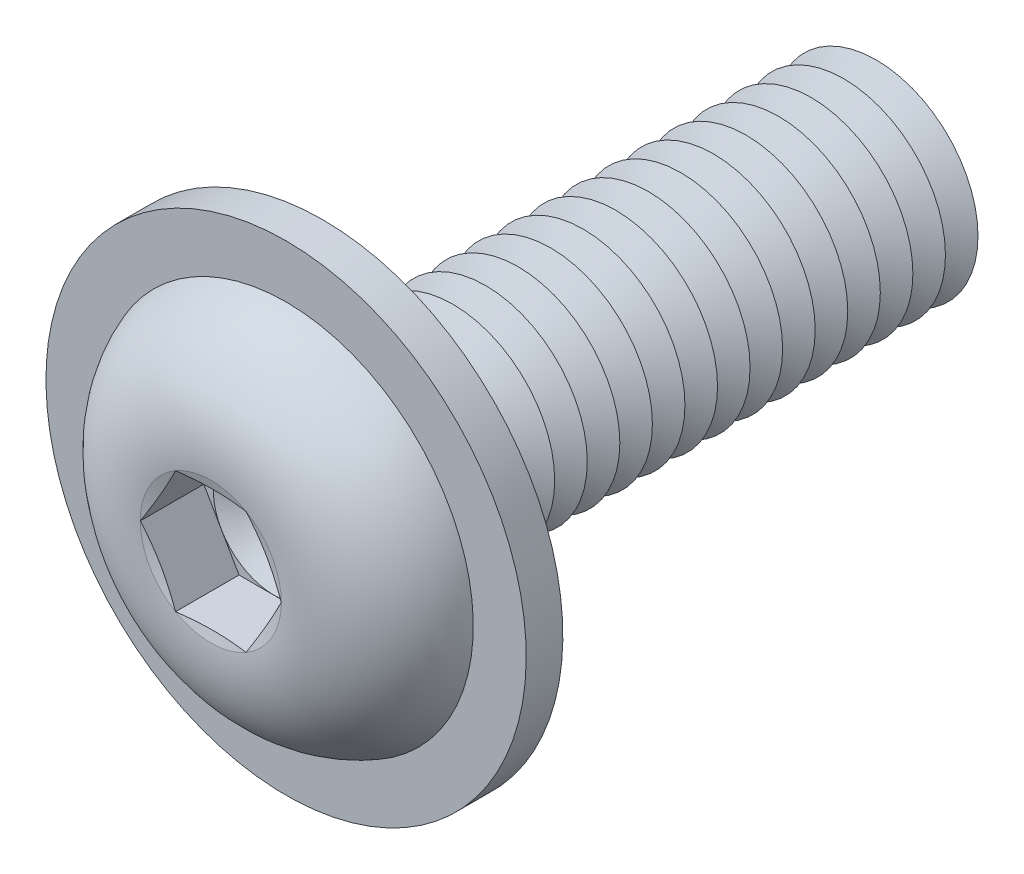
ISO-10303-21;
HEADER;
FILE_DESCRIPTION(('STEP AP214'),'2;1');
FILE_NAME('part.step','',(''),(''),'','','');
FILE_SCHEMA(('AUTOMOTIVE_DESIGN { 1 0 10303 214 1 1 1 1 }'));
ENDSEC;
DATA;
#1=APPLICATION_CONTEXT('core data for automotive mechanical design processes');
#2=APPLICATION_PROTOCOL_DEFINITION('international standard','automotive_design',2000,#1);
#3=PRODUCT_CONTEXT('',#1,'mechanical');
#4=PRODUCT('Part','Part','',(#3));
#5=PRODUCT_RELATED_PRODUCT_CATEGORY('part','',(#4));
#6=PRODUCT_DEFINITION_FORMATION('','',#4);
#7=PRODUCT_DEFINITION_CONTEXT('part definition',#1,'design');
#8=PRODUCT_DEFINITION('design','',#6,#7);
#9=PRODUCT_DEFINITION_SHAPE('','',#8);
#10=(LENGTH_UNIT() NAMED_UNIT(*) SI_UNIT(.MILLI.,.METRE.));
#11=(NAMED_UNIT(*) PLANE_ANGLE_UNIT() SI_UNIT($,.RADIAN.));
#12=(NAMED_UNIT(*) SI_UNIT($,.STERADIAN.) SOLID_ANGLE_UNIT());
#13=UNCERTAINTY_MEASURE_WITH_UNIT(LENGTH_MEASURE(1.E-05),#10,'distance_accuracy_value','');
#14=(GEOMETRIC_REPRESENTATION_CONTEXT(3) GLOBAL_UNCERTAINTY_ASSIGNED_CONTEXT((#13)) GLOBAL_UNIT_ASSIGNED_CONTEXT((#10,
#11,#12)) REPRESENTATION_CONTEXT('',''));
#15=CARTESIAN_POINT('',(0.,0.,0.));
#16=DIRECTION('',(0.,0.,1.));
#17=DIRECTION('',(1.,0.,0.));
#18=AXIS2_PLACEMENT_3D('',#15,#16,#17);
#19=CARTESIAN_POINT('',(0.,0.,-11.2));
#20=DIRECTION('',(0.,0.,1.));
#21=DIRECTION('',(1.,0.,0.));
#22=AXIS2_PLACEMENT_3D('',#19,#20,#21);
#23=CONICAL_SURFACE('',#22,2.50000000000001,1.0471975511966);
#24=CARTESIAN_POINT('',(0.,0.,-11.6));
#25=DIRECTION('',(0.,0.,1.));
#26=DIRECTION('',(1.,0.,0.));
#27=AXIS2_PLACEMENT_3D('',#24,#25,#26);
#28=CIRCLE('',#27,1.80717967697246);
#29=CARTESIAN_POINT('',(1.80717967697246,0.,-11.6));
#30=VERTEX_POINT('',#29);
#31=EDGE_CURVE('E346',#30,#30,#28,.T.);
#32=ORIENTED_EDGE('',*,*,#31,.T.);
#33=EDGE_LOOP('',(#32));
#34=FACE_BOUND('',#33,.T.);
#35=CARTESIAN_POINT('',(0.,0.,-11.2));
#36=DIRECTION('',(0.,0.,1.));
#37=DIRECTION('',(1.,0.,0.));
#38=AXIS2_PLACEMENT_3D('',#35,#36,#37);
#39=CIRCLE('',#38,2.50000000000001);
#40=CARTESIAN_POINT('',(2.50000000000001,0.,-11.2));
#41=VERTEX_POINT('',#40);
#42=EDGE_CURVE('E342',#41,#41,#39,.T.);
#43=ORIENTED_EDGE('',*,*,#42,.F.);
#44=EDGE_LOOP('',(#43));
#45=FACE_BOUND('',#44,.T.);
#46=ADVANCED_FACE('F39',(#34,#45),#23,.T.);
#47=CARTESIAN_POINT('',(0.,0.,-11.6));
#48=DIRECTION('',(0.,0.,-1.));
#49=DIRECTION('',(-1.,0.,0.));
#50=AXIS2_PLACEMENT_3D('',#47,#48,#49);
#51=CONICAL_SURFACE('',#50,1.80717967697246,1.0471975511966);
#52=CARTESIAN_POINT('',(0.,0.,-12.));
#53=DIRECTION('',(0.,0.,1.));
#54=DIRECTION('',(1.,0.,0.));
#55=AXIS2_PLACEMENT_3D('',#52,#53,#54);
#56=CIRCLE('',#55,2.50000000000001);
#57=CARTESIAN_POINT('',(2.50000000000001,0.,-12.));
#58=VERTEX_POINT('',#57);
#59=EDGE_CURVE('E350',#58,#58,#56,.T.);
#60=ORIENTED_EDGE('',*,*,#59,.T.);
#61=EDGE_LOOP('',(#60));
#62=FACE_BOUND('',#61,.T.);
#63=ORIENTED_EDGE('',*,*,#31,.F.);
#64=EDGE_LOOP('',(#63));
#65=FACE_BOUND('',#64,.T.);
#66=ADVANCED_FACE('F474',(#62,#65),#51,.T.);
#67=CARTESIAN_POINT('',(0.,2.50000000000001,-14.));
#68=DIRECTION('',(0.,0.,-1.));
#69=DIRECTION('',(-1.,0.,0.));
#70=AXIS2_PLACEMENT_3D('',#67,#68,#69);
#71=PLANE('',#70);
#72=CARTESIAN_POINT('',(0.,0.,-14.));
#73=DIRECTION('',(0.,0.,1.));
#74=DIRECTION('',(1.,0.,0.));
#75=AXIS2_PLACEMENT_3D('',#72,#73,#74);
#76=CIRCLE('',#75,1.80717967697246);
#77=CARTESIAN_POINT('',(1.80717967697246,0.,-14.));
#78=VERTEX_POINT('',#77);
#79=EDGE_CURVE('E370',#78,#78,#76,.T.);
#80=ORIENTED_EDGE('',*,*,#79,.F.);
#81=EDGE_LOOP('',(#80));
#82=FACE_BOUND('',#81,.T.);
#83=ADVANCED_FACE('F480',(#82),#71,.T.);
#84=CARTESIAN_POINT('',(0.,0.,-13.6));
#85=DIRECTION('',(0.,0.,1.));
#86=DIRECTION('',(1.,0.,0.));
#87=AXIS2_PLACEMENT_3D('',#84,#85,#86);
#88=CONICAL_SURFACE('',#87,2.50000000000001,1.0471975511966);
#89=ORIENTED_EDGE('',*,*,#79,.T.);
#90=EDGE_LOOP('',(#89));
#91=FACE_BOUND('',#90,.T.);
#92=CARTESIAN_POINT('',(0.,0.,-13.6));
#93=DIRECTION('',(0.,0.,1.));
#94=DIRECTION('',(1.,0.,0.));
#95=AXIS2_PLACEMENT_3D('',#92,#93,#94);
#96=CIRCLE('',#95,2.50000000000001);
#97=CARTESIAN_POINT('',(2.50000000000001,0.,-13.6));
#98=VERTEX_POINT('',#97);
#99=EDGE_CURVE('E366',#98,#98,#96,.T.);
#100=ORIENTED_EDGE('',*,*,#99,.F.);
#101=EDGE_LOOP('',(#100));
#102=FACE_BOUND('',#101,.T.);
#103=ADVANCED_FACE('F499',(#91,#102),#88,.T.);
#104=CARTESIAN_POINT('',(0.,0.,-13.2));
#105=DIRECTION('',(0.,0.,-1.));
#106=DIRECTION('',(-1.,0.,0.));
#107=AXIS2_PLACEMENT_3D('',#104,#105,#106);
#108=CONICAL_SURFACE('',#107,1.80717967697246,1.0471975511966);
#109=ORIENTED_EDGE('',*,*,#99,.T.);
#110=EDGE_LOOP('',(#109));
#111=FACE_BOUND('',#110,.T.);
#112=CARTESIAN_POINT('',(0.,0.,-13.2));
#113=DIRECTION('',(0.,0.,1.));
#114=DIRECTION('',(1.,0.,0.));
#115=AXIS2_PLACEMENT_3D('',#112,#113,#114);
#116=CIRCLE('',#115,1.80717967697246);
#117=CARTESIAN_POINT('',(1.80717967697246,0.,-13.2));
#118=VERTEX_POINT('',#117);
#119=EDGE_CURVE('E362',#118,#118,#116,.T.);
#120=ORIENTED_EDGE('',*,*,#119,.F.);
#121=EDGE_LOOP('',(#120));
#122=FACE_BOUND('',#121,.T.);
#123=ADVANCED_FACE('F496',(#111,#122),#108,.T.);
#124=CARTESIAN_POINT('',(0.,0.,-12.8));
#125=DIRECTION('',(0.,0.,1.));
#126=DIRECTION('',(1.,0.,0.));
#127=AXIS2_PLACEMENT_3D('',#124,#125,#126);
#128=CONICAL_SURFACE('',#127,2.50000000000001,1.0471975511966);
#129=ORIENTED_EDGE('',*,*,#119,.T.);
#130=EDGE_LOOP('',(#129));
#131=FACE_BOUND('',#130,.T.);
#132=CARTESIAN_POINT('',(0.,0.,-12.8));
#133=DIRECTION('',(0.,0.,1.));
#134=DIRECTION('',(1.,0.,0.));
#135=AXIS2_PLACEMENT_3D('',#132,#133,#134);
#136=CIRCLE('',#135,2.50000000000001);
#137=CARTESIAN_POINT('',(2.50000000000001,0.,-12.8));
#138=VERTEX_POINT('',#137);
#139=EDGE_CURVE('E358',#138,#138,#136,.T.);
#140=ORIENTED_EDGE('',*,*,#139,.F.);
#141=EDGE_LOOP('',(#140));
#142=FACE_BOUND('',#141,.T.);
#143=ADVANCED_FACE('F490',(#131,#142),#128,.T.);
#144=CARTESIAN_POINT('',(0.,0.,-12.4));
#145=DIRECTION('',(0.,0.,-1.));
#146=DIRECTION('',(-1.,0.,0.));
#147=AXIS2_PLACEMENT_3D('',#144,#145,#146);
#148=CONICAL_SURFACE('',#147,1.80717967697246,1.0471975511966);
#149=ORIENTED_EDGE('',*,*,#139,.T.);
#150=EDGE_LOOP('',(#149));
#151=FACE_BOUND('',#150,.T.);
#152=CARTESIAN_POINT('',(0.,0.,-12.4));
#153=DIRECTION('',(0.,0.,1.));
#154=DIRECTION('',(1.,0.,0.));
#155=AXIS2_PLACEMENT_3D('',#152,#153,#154);
#156=CIRCLE('',#155,1.80717967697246);
#157=CARTESIAN_POINT('',(1.80717967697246,0.,-12.4));
#158=VERTEX_POINT('',#157);
#159=EDGE_CURVE('E354',#158,#158,#156,.T.);
#160=ORIENTED_EDGE('',*,*,#159,.F.);
#161=EDGE_LOOP('',(#160));
#162=FACE_BOUND('',#161,.T.);
#163=ADVANCED_FACE('F486',(#151,#162),#148,.T.);
#164=CARTESIAN_POINT('',(0.,0.,-12.));
#165=DIRECTION('',(0.,0.,1.));
#166=DIRECTION('',(1.,0.,0.));
#167=AXIS2_PLACEMENT_3D('',#164,#165,#166);
#168=CONICAL_SURFACE('',#167,2.50000000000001,1.0471975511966);
#169=ORIENTED_EDGE('',*,*,#159,.T.);
#170=EDGE_LOOP('',(#169));
#171=FACE_BOUND('',#170,.T.);
#172=ORIENTED_EDGE('',*,*,#59,.F.);
#173=EDGE_LOOP('',(#172));
#174=FACE_BOUND('',#173,.T.);
#175=ADVANCED_FACE('F489',(#171,#174),#168,.T.);
#176=CARTESIAN_POINT('',(0.,0.,-10.4));
#177=DIRECTION('',(0.,0.,1.));
#178=DIRECTION('',(1.,0.,0.));
#179=AXIS2_PLACEMENT_3D('',#176,#177,#178);
#180=CONICAL_SURFACE('',#179,2.50000000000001,1.0471975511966);
#181=CARTESIAN_POINT('',(0.,0.,-10.8));
#182=DIRECTION('',(0.,0.,1.));
#183=DIRECTION('',(1.,0.,0.));
#184=AXIS2_PLACEMENT_3D('',#181,#182,#183);
#185=CIRCLE('',#184,1.80717967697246);
#186=CARTESIAN_POINT('',(1.80717967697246,0.,-10.8));
#187=VERTEX_POINT('',#186);
#188=EDGE_CURVE('E338',#187,#187,#185,.T.);
#189=ORIENTED_EDGE('',*,*,#188,.T.);
#190=EDGE_LOOP('',(#189));
#191=FACE_BOUND('',#190,.T.);
#192=CARTESIAN_POINT('',(0.,0.,-10.4));
#193=DIRECTION('',(0.,0.,1.));
#194=DIRECTION('',(1.,0.,0.));
#195=AXIS2_PLACEMENT_3D('',#192,#193,#194);
#196=CIRCLE('',#195,2.50000000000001);
#197=CARTESIAN_POINT('',(2.50000000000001,0.,-10.4));
#198=VERTEX_POINT('',#197);
#199=EDGE_CURVE('E334',#198,#198,#196,.T.);
#200=ORIENTED_EDGE('',*,*,#199,.F.);
#201=EDGE_LOOP('',(#200));
#202=FACE_BOUND('',#201,.T.);
#203=ADVANCED_FACE('F494',(#191,#202),#180,.T.);
#204=CARTESIAN_POINT('',(0.,0.,-10.8));
#205=DIRECTION('',(0.,0.,-1.));
#206=DIRECTION('',(-1.,0.,0.));
#207=AXIS2_PLACEMENT_3D('',#204,#205,#206);
#208=CONICAL_SURFACE('',#207,1.80717967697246,1.0471975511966);
#209=ORIENTED_EDGE('',*,*,#42,.T.);
#210=EDGE_LOOP('',(#209));
#211=FACE_BOUND('',#210,.T.);
#212=ORIENTED_EDGE('',*,*,#188,.F.);
#213=EDGE_LOOP('',(#212));
#214=FACE_BOUND('',#213,.T.);
#215=ADVANCED_FACE('F545',(#211,#214),#208,.T.);
#216=CARTESIAN_POINT('',(0.,0.,-9.6));
#217=DIRECTION('',(0.,0.,1.));
#218=DIRECTION('',(1.,0.,0.));
#219=AXIS2_PLACEMENT_3D('',#216,#217,#218);
#220=CONICAL_SURFACE('',#219,2.50000000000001,1.0471975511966);
#221=CARTESIAN_POINT('',(0.,0.,-10.));
#222=DIRECTION('',(0.,0.,1.));
#223=DIRECTION('',(1.,0.,0.));
#224=AXIS2_PLACEMENT_3D('',#221,#222,#223);
#225=CIRCLE('',#224,1.80717967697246);
#226=CARTESIAN_POINT('',(1.80717967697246,0.,-10.));
#227=VERTEX_POINT('',#226);
#228=EDGE_CURVE('E330',#227,#227,#225,.T.);
#229=ORIENTED_EDGE('',*,*,#228,.T.);
#230=EDGE_LOOP('',(#229));
#231=FACE_BOUND('',#230,.T.);
#232=CARTESIAN_POINT('',(0.,0.,-9.6));
#233=DIRECTION('',(0.,0.,1.));
#234=DIRECTION('',(1.,0.,0.));
#235=AXIS2_PLACEMENT_3D('',#232,#233,#234);
#236=CIRCLE('',#235,2.50000000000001);
#237=CARTESIAN_POINT('',(2.50000000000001,0.,-9.6));
#238=VERTEX_POINT('',#237);
#239=EDGE_CURVE('E326',#238,#238,#236,.T.);
#240=ORIENTED_EDGE('',*,*,#239,.F.);
#241=EDGE_LOOP('',(#240));
#242=FACE_BOUND('',#241,.T.);
#243=ADVANCED_FACE('F551',(#231,#242),#220,.T.);
#244=CARTESIAN_POINT('',(0.,0.,-10.));
#245=DIRECTION('',(0.,0.,-1.));
#246=DIRECTION('',(-1.,0.,0.));
#247=AXIS2_PLACEMENT_3D('',#244,#245,#246);
#248=CONICAL_SURFACE('',#247,1.80717967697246,1.0471975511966);
#249=ORIENTED_EDGE('',*,*,#199,.T.);
#250=EDGE_LOOP('',(#249));
#251=FACE_BOUND('',#250,.T.);
#252=ORIENTED_EDGE('',*,*,#228,.F.);
#253=EDGE_LOOP('',(#252));
#254=FACE_BOUND('',#253,.T.);
#255=ADVANCED_FACE('F558',(#251,#254),#248,.T.);
#256=CARTESIAN_POINT('',(0.,0.,-8.8));
#257=DIRECTION('',(0.,0.,1.));
#258=DIRECTION('',(1.,0.,0.));
#259=AXIS2_PLACEMENT_3D('',#256,#257,#258);
#260=CONICAL_SURFACE('',#259,2.50000000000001,1.0471975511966);
#261=CARTESIAN_POINT('',(0.,0.,-9.2));
#262=DIRECTION('',(0.,0.,1.));
#263=DIRECTION('',(1.,0.,0.));
#264=AXIS2_PLACEMENT_3D('',#261,#262,#263);
#265=CIRCLE('',#264,1.80717967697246);
#266=CARTESIAN_POINT('',(1.80717967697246,0.,-9.2));
#267=VERTEX_POINT('',#266);
#268=EDGE_CURVE('E322',#267,#267,#265,.T.);
#269=ORIENTED_EDGE('',*,*,#268,.T.);
#270=EDGE_LOOP('',(#269));
#271=FACE_BOUND('',#270,.T.);
#272=CARTESIAN_POINT('',(0.,0.,-8.8));
#273=DIRECTION('',(0.,0.,1.));
#274=DIRECTION('',(1.,0.,0.));
#275=AXIS2_PLACEMENT_3D('',#272,#273,#274);
#276=CIRCLE('',#275,2.50000000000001);
#277=CARTESIAN_POINT('',(2.50000000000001,0.,-8.8));
#278=VERTEX_POINT('',#277);
#279=EDGE_CURVE('E318',#278,#278,#276,.T.);
#280=ORIENTED_EDGE('',*,*,#279,.F.);
#281=EDGE_LOOP('',(#280));
#282=FACE_BOUND('',#281,.T.);
#283=ADVANCED_FACE('F565',(#271,#282),#260,.T.);
#284=CARTESIAN_POINT('',(0.,0.,-9.2));
#285=DIRECTION('',(0.,0.,-1.));
#286=DIRECTION('',(-1.,0.,0.));
#287=AXIS2_PLACEMENT_3D('',#284,#285,#286);
#288=CONICAL_SURFACE('',#287,1.80717967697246,1.0471975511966);
#289=ORIENTED_EDGE('',*,*,#239,.T.);
#290=EDGE_LOOP('',(#289));
#291=FACE_BOUND('',#290,.T.);
#292=ORIENTED_EDGE('',*,*,#268,.F.);
#293=EDGE_LOOP('',(#292));
#294=FACE_BOUND('',#293,.T.);
#295=ADVANCED_FACE('F572',(#291,#294),#288,.T.);
#296=CARTESIAN_POINT('',(0.,0.,-8.));
#297=DIRECTION('',(0.,0.,1.));
#298=DIRECTION('',(1.,0.,0.));
#299=AXIS2_PLACEMENT_3D('',#296,#297,#298);
#300=CONICAL_SURFACE('',#299,2.50000000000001,1.0471975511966);
#301=CARTESIAN_POINT('',(0.,0.,-8.4));
#302=DIRECTION('',(0.,0.,1.));
#303=DIRECTION('',(1.,0.,0.));
#304=AXIS2_PLACEMENT_3D('',#301,#302,#303);
#305=CIRCLE('',#304,1.80717967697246);
#306=CARTESIAN_POINT('',(1.80717967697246,0.,-8.4));
#307=VERTEX_POINT('',#306);
#308=EDGE_CURVE('E314',#307,#307,#305,.T.);
#309=ORIENTED_EDGE('',*,*,#308,.T.);
#310=EDGE_LOOP('',(#309));
#311=FACE_BOUND('',#310,.T.);
#312=CARTESIAN_POINT('',(0.,0.,-8.));
#313=DIRECTION('',(0.,0.,1.));
#314=DIRECTION('',(1.,0.,0.));
#315=AXIS2_PLACEMENT_3D('',#312,#313,#314);
#316=CIRCLE('',#315,2.50000000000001);
#317=CARTESIAN_POINT('',(2.50000000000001,0.,-8.));
#318=VERTEX_POINT('',#317);
#319=EDGE_CURVE('E310',#318,#318,#316,.T.);
#320=ORIENTED_EDGE('',*,*,#319,.F.);
#321=EDGE_LOOP('',(#320));
#322=FACE_BOUND('',#321,.T.);
#323=ADVANCED_FACE('F579',(#311,#322),#300,.T.);
#324=CARTESIAN_POINT('',(0.,0.,-8.4));
#325=DIRECTION('',(0.,0.,-1.));
#326=DIRECTION('',(-1.,0.,0.));
#327=AXIS2_PLACEMENT_3D('',#324,#325,#326);
#328=CONICAL_SURFACE('',#327,1.80717967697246,1.0471975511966);
#329=ORIENTED_EDGE('',*,*,#279,.T.);
#330=EDGE_LOOP('',(#329));
#331=FACE_BOUND('',#330,.T.);
#332=ORIENTED_EDGE('',*,*,#308,.F.);
#333=EDGE_LOOP('',(#332));
#334=FACE_BOUND('',#333,.T.);
#335=ADVANCED_FACE('F586',(#331,#334),#328,.T.);
#336=CARTESIAN_POINT('',(0.,0.,-7.2));
#337=DIRECTION('',(0.,0.,1.));
#338=DIRECTION('',(1.,0.,0.));
#339=AXIS2_PLACEMENT_3D('',#336,#337,#338);
#340=CONICAL_SURFACE('',#339,2.50000000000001,1.0471975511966);
#341=CARTESIAN_POINT('',(0.,0.,-7.6));
#342=DIRECTION('',(0.,0.,1.));
#343=DIRECTION('',(1.,0.,0.));
#344=AXIS2_PLACEMENT_3D('',#341,#342,#343);
#345=CIRCLE('',#344,1.80717967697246);
#346=CARTESIAN_POINT('',(1.80717967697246,0.,-7.6));
#347=VERTEX_POINT('',#346);
#348=EDGE_CURVE('E306',#347,#347,#345,.T.);
#349=ORIENTED_EDGE('',*,*,#348,.T.);
#350=EDGE_LOOP('',(#349));
#351=FACE_BOUND('',#350,.T.);
#352=CARTESIAN_POINT('',(0.,0.,-7.2));
#353=DIRECTION('',(0.,0.,1.));
#354=DIRECTION('',(1.,0.,0.));
#355=AXIS2_PLACEMENT_3D('',#352,#353,#354);
#356=CIRCLE('',#355,2.50000000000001);
#357=CARTESIAN_POINT('',(2.50000000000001,0.,-7.2));
#358=VERTEX_POINT('',#357);
#359=EDGE_CURVE('E302',#358,#358,#356,.T.);
#360=ORIENTED_EDGE('',*,*,#359,.F.);
#361=EDGE_LOOP('',(#360));
#362=FACE_BOUND('',#361,.T.);
#363=ADVANCED_FACE('F593',(#351,#362),#340,.T.);
#364=CARTESIAN_POINT('',(0.,0.,-7.6));
#365=DIRECTION('',(0.,0.,-1.));
#366=DIRECTION('',(-1.,0.,0.));
#367=AXIS2_PLACEMENT_3D('',#364,#365,#366);
#368=CONICAL_SURFACE('',#367,1.80717967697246,1.0471975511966);
#369=ORIENTED_EDGE('',*,*,#319,.T.);
#370=EDGE_LOOP('',(#369));
#371=FACE_BOUND('',#370,.T.);
#372=ORIENTED_EDGE('',*,*,#348,.F.);
#373=EDGE_LOOP('',(#372));
#374=FACE_BOUND('',#373,.T.);
#375=ADVANCED_FACE('F600',(#371,#374),#368,.T.);
#376=CARTESIAN_POINT('',(0.,0.,-6.4));
#377=DIRECTION('',(0.,0.,1.));
#378=DIRECTION('',(1.,0.,0.));
#379=AXIS2_PLACEMENT_3D('',#376,#377,#378);
#380=CONICAL_SURFACE('',#379,2.50000000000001,1.0471975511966);
#381=CARTESIAN_POINT('',(0.,0.,-6.8));
#382=DIRECTION('',(0.,0.,1.));
#383=DIRECTION('',(1.,0.,0.));
#384=AXIS2_PLACEMENT_3D('',#381,#382,#383);
#385=CIRCLE('',#384,1.80717967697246);
#386=CARTESIAN_POINT('',(1.80717967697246,0.,-6.8));
#387=VERTEX_POINT('',#386);
#388=EDGE_CURVE('E298',#387,#387,#385,.T.);
#389=ORIENTED_EDGE('',*,*,#388,.T.);
#390=EDGE_LOOP('',(#389));
#391=FACE_BOUND('',#390,.T.);
#392=CARTESIAN_POINT('',(0.,0.,-6.4));
#393=DIRECTION('',(0.,0.,1.));
#394=DIRECTION('',(1.,0.,0.));
#395=AXIS2_PLACEMENT_3D('',#392,#393,#394);
#396=CIRCLE('',#395,2.50000000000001);
#397=CARTESIAN_POINT('',(2.50000000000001,0.,-6.4));
#398=VERTEX_POINT('',#397);
#399=EDGE_CURVE('E294',#398,#398,#396,.T.);
#400=ORIENTED_EDGE('',*,*,#399,.F.);
#401=EDGE_LOOP('',(#400));
#402=FACE_BOUND('',#401,.T.);
#403=ADVANCED_FACE('F607',(#391,#402),#380,.T.);
#404=CARTESIAN_POINT('',(0.,0.,-6.8));
#405=DIRECTION('',(0.,0.,-1.));
#406=DIRECTION('',(-1.,0.,0.));
#407=AXIS2_PLACEMENT_3D('',#404,#405,#406);
#408=CONICAL_SURFACE('',#407,1.80717967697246,1.0471975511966);
#409=ORIENTED_EDGE('',*,*,#359,.T.);
#410=EDGE_LOOP('',(#409));
#411=FACE_BOUND('',#410,.T.);
#412=ORIENTED_EDGE('',*,*,#388,.F.);
#413=EDGE_LOOP('',(#412));
#414=FACE_BOUND('',#413,.T.);
#415=ADVANCED_FACE('F614',(#411,#414),#408,.T.);
#416=CARTESIAN_POINT('',(0.,0.,-5.6));
#417=DIRECTION('',(0.,0.,1.));
#418=DIRECTION('',(1.,0.,0.));
#419=AXIS2_PLACEMENT_3D('',#416,#417,#418);
#420=CONICAL_SURFACE('',#419,2.50000000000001,1.0471975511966);
#421=CARTESIAN_POINT('',(0.,0.,-6.));
#422=DIRECTION('',(0.,0.,1.));
#423=DIRECTION('',(1.,0.,0.));
#424=AXIS2_PLACEMENT_3D('',#421,#422,#423);
#425=CIRCLE('',#424,1.80717967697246);
#426=CARTESIAN_POINT('',(1.80717967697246,0.,-6.));
#427=VERTEX_POINT('',#426);
#428=EDGE_CURVE('E290',#427,#427,#425,.T.);
#429=ORIENTED_EDGE('',*,*,#428,.T.);
#430=EDGE_LOOP('',(#429));
#431=FACE_BOUND('',#430,.T.);
#432=CARTESIAN_POINT('',(0.,0.,-5.6));
#433=DIRECTION('',(0.,0.,1.));
#434=DIRECTION('',(1.,0.,0.));
#435=AXIS2_PLACEMENT_3D('',#432,#433,#434);
#436=CIRCLE('',#435,2.50000000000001);
#437=CARTESIAN_POINT('',(2.50000000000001,0.,-5.6));
#438=VERTEX_POINT('',#437);
#439=EDGE_CURVE('E286',#438,#438,#436,.T.);
#440=ORIENTED_EDGE('',*,*,#439,.F.);
#441=EDGE_LOOP('',(#440));
#442=FACE_BOUND('',#441,.T.);
#443=ADVANCED_FACE('F621',(#431,#442),#420,.T.);
#444=CARTESIAN_POINT('',(0.,0.,-6.));
#445=DIRECTION('',(0.,0.,-1.));
#446=DIRECTION('',(-1.,0.,0.));
#447=AXIS2_PLACEMENT_3D('',#444,#445,#446);
#448=CONICAL_SURFACE('',#447,1.80717967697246,1.0471975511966);
#449=ORIENTED_EDGE('',*,*,#399,.T.);
#450=EDGE_LOOP('',(#449));
#451=FACE_BOUND('',#450,.T.);
#452=ORIENTED_EDGE('',*,*,#428,.F.);
#453=EDGE_LOOP('',(#452));
#454=FACE_BOUND('',#453,.T.);
#455=ADVANCED_FACE('F628',(#451,#454),#448,.T.);
#456=CARTESIAN_POINT('',(0.,0.,-4.8));
#457=DIRECTION('',(0.,0.,1.));
#458=DIRECTION('',(1.,0.,0.));
#459=AXIS2_PLACEMENT_3D('',#456,#457,#458);
#460=CONICAL_SURFACE('',#459,2.50000000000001,1.0471975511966);
#461=CARTESIAN_POINT('',(0.,0.,-5.2));
#462=DIRECTION('',(0.,0.,1.));
#463=DIRECTION('',(1.,0.,0.));
#464=AXIS2_PLACEMENT_3D('',#461,#462,#463);
#465=CIRCLE('',#464,1.80717967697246);
#466=CARTESIAN_POINT('',(1.80717967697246,0.,-5.2));
#467=VERTEX_POINT('',#466);
#468=EDGE_CURVE('E282',#467,#467,#465,.T.);
#469=ORIENTED_EDGE('',*,*,#468,.T.);
#470=EDGE_LOOP('',(#469));
#471=FACE_BOUND('',#470,.T.);
#472=CARTESIAN_POINT('',(0.,0.,-4.8));
#473=DIRECTION('',(0.,0.,1.));
#474=DIRECTION('',(1.,0.,0.));
#475=AXIS2_PLACEMENT_3D('',#472,#473,#474);
#476=CIRCLE('',#475,2.50000000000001);
#477=CARTESIAN_POINT('',(2.50000000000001,0.,-4.8));
#478=VERTEX_POINT('',#477);
#479=EDGE_CURVE('E278',#478,#478,#476,.T.);
#480=ORIENTED_EDGE('',*,*,#479,.F.);
#481=EDGE_LOOP('',(#480));
#482=FACE_BOUND('',#481,.T.);
#483=ADVANCED_FACE('F635',(#471,#482),#460,.T.);
#484=CARTESIAN_POINT('',(0.,0.,-5.2));
#485=DIRECTION('',(0.,0.,-1.));
#486=DIRECTION('',(-1.,0.,0.));
#487=AXIS2_PLACEMENT_3D('',#484,#485,#486);
#488=CONICAL_SURFACE('',#487,1.80717967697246,1.0471975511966);
#489=ORIENTED_EDGE('',*,*,#439,.T.);
#490=EDGE_LOOP('',(#489));
#491=FACE_BOUND('',#490,.T.);
#492=ORIENTED_EDGE('',*,*,#468,.F.);
#493=EDGE_LOOP('',(#492));
#494=FACE_BOUND('',#493,.T.);
#495=ADVANCED_FACE('F642',(#491,#494),#488,.T.);
#496=CARTESIAN_POINT('',(0.,0.,-4.));
#497=DIRECTION('',(0.,0.,1.));
#498=DIRECTION('',(1.,0.,0.));
#499=AXIS2_PLACEMENT_3D('',#496,#497,#498);
#500=CONICAL_SURFACE('',#499,2.50000000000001,1.0471975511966);
#501=CARTESIAN_POINT('',(0.,0.,-4.4));
#502=DIRECTION('',(0.,0.,1.));
#503=DIRECTION('',(1.,0.,0.));
#504=AXIS2_PLACEMENT_3D('',#501,#502,#503);
#505=CIRCLE('',#504,1.80717967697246);
#506=CARTESIAN_POINT('',(1.80717967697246,0.,-4.4));
#507=VERTEX_POINT('',#506);
#508=EDGE_CURVE('E274',#507,#507,#505,.T.);
#509=ORIENTED_EDGE('',*,*,#508,.T.);
#510=EDGE_LOOP('',(#509));
#511=FACE_BOUND('',#510,.T.);
#512=CARTESIAN_POINT('',(0.,0.,-4.));
#513=DIRECTION('',(0.,0.,1.));
#514=DIRECTION('',(1.,0.,0.));
#515=AXIS2_PLACEMENT_3D('',#512,#513,#514);
#516=CIRCLE('',#515,2.50000000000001);
#517=CARTESIAN_POINT('',(2.50000000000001,0.,-4.));
#518=VERTEX_POINT('',#517);
#519=EDGE_CURVE('E270',#518,#518,#516,.T.);
#520=ORIENTED_EDGE('',*,*,#519,.F.);
#521=EDGE_LOOP('',(#520));
#522=FACE_BOUND('',#521,.T.);
#523=ADVANCED_FACE('F649',(#511,#522),#500,.T.);
#524=CARTESIAN_POINT('',(0.,0.,-4.4));
#525=DIRECTION('',(0.,0.,-1.));
#526=DIRECTION('',(-1.,0.,0.));
#527=AXIS2_PLACEMENT_3D('',#524,#525,#526);
#528=CONICAL_SURFACE('',#527,1.80717967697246,1.0471975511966);
#529=ORIENTED_EDGE('',*,*,#479,.T.);
#530=EDGE_LOOP('',(#529));
#531=FACE_BOUND('',#530,.T.);
#532=ORIENTED_EDGE('',*,*,#508,.F.);
#533=EDGE_LOOP('',(#532));
#534=FACE_BOUND('',#533,.T.);
#535=ADVANCED_FACE('F656',(#531,#534),#528,.T.);
#536=CARTESIAN_POINT('',(0.,0.,-3.2));
#537=DIRECTION('',(0.,0.,1.));
#538=DIRECTION('',(1.,0.,0.));
#539=AXIS2_PLACEMENT_3D('',#536,#537,#538);
#540=CONICAL_SURFACE('',#539,2.50000000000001,1.0471975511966);
#541=CARTESIAN_POINT('',(0.,0.,-3.6));
#542=DIRECTION('',(0.,0.,1.));
#543=DIRECTION('',(1.,0.,0.));
#544=AXIS2_PLACEMENT_3D('',#541,#542,#543);
#545=CIRCLE('',#544,1.80717967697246);
#546=CARTESIAN_POINT('',(1.80717967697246,0.,-3.6));
#547=VERTEX_POINT('',#546);
#548=EDGE_CURVE('E266',#547,#547,#545,.T.);
#549=ORIENTED_EDGE('',*,*,#548,.T.);
#550=EDGE_LOOP('',(#549));
#551=FACE_BOUND('',#550,.T.);
#552=CARTESIAN_POINT('',(0.,0.,-3.2));
#553=DIRECTION('',(0.,0.,1.));
#554=DIRECTION('',(1.,0.,0.));
#555=AXIS2_PLACEMENT_3D('',#552,#553,#554);
#556=CIRCLE('',#555,2.50000000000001);
#557=CARTESIAN_POINT('',(2.50000000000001,0.,-3.2));
#558=VERTEX_POINT('',#557);
#559=EDGE_CURVE('E262',#558,#558,#556,.T.);
#560=ORIENTED_EDGE('',*,*,#559,.F.);
#561=EDGE_LOOP('',(#560));
#562=FACE_BOUND('',#561,.T.);
#563=ADVANCED_FACE('F663',(#551,#562),#540,.T.);
#564=CARTESIAN_POINT('',(0.,0.,-3.6));
#565=DIRECTION('',(0.,0.,-1.));
#566=DIRECTION('',(-1.,0.,0.));
#567=AXIS2_PLACEMENT_3D('',#564,#565,#566);
#568=CONICAL_SURFACE('',#567,1.80717967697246,1.0471975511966);
#569=ORIENTED_EDGE('',*,*,#519,.T.);
#570=EDGE_LOOP('',(#569));
#571=FACE_BOUND('',#570,.T.);
#572=ORIENTED_EDGE('',*,*,#548,.F.);
#573=EDGE_LOOP('',(#572));
#574=FACE_BOUND('',#573,.T.);
#575=ADVANCED_FACE('F670',(#571,#574),#568,.T.);
#576=CARTESIAN_POINT('',(0.,0.,-2.4));
#577=DIRECTION('',(0.,0.,1.));
#578=DIRECTION('',(1.,0.,0.));
#579=AXIS2_PLACEMENT_3D('',#576,#577,#578);
#580=CONICAL_SURFACE('',#579,2.50000000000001,1.0471975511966);
#581=CARTESIAN_POINT('',(0.,0.,-2.8));
#582=DIRECTION('',(0.,0.,1.));
#583=DIRECTION('',(1.,0.,0.));
#584=AXIS2_PLACEMENT_3D('',#581,#582,#583);
#585=CIRCLE('',#584,1.80717967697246);
#586=CARTESIAN_POINT('',(1.80717967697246,0.,-2.8));
#587=VERTEX_POINT('',#586);
#588=EDGE_CURVE('E258',#587,#587,#585,.T.);
#589=ORIENTED_EDGE('',*,*,#588,.T.);
#590=EDGE_LOOP('',(#589));
#591=FACE_BOUND('',#590,.T.);
#592=CARTESIAN_POINT('',(0.,0.,-2.4));
#593=DIRECTION('',(0.,0.,1.));
#594=DIRECTION('',(1.,0.,0.));
#595=AXIS2_PLACEMENT_3D('',#592,#593,#594);
#596=CIRCLE('',#595,2.50000000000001);
#597=CARTESIAN_POINT('',(2.50000000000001,0.,-2.4));
#598=VERTEX_POINT('',#597);
#599=EDGE_CURVE('E254',#598,#598,#596,.T.);
#600=ORIENTED_EDGE('',*,*,#599,.F.);
#601=EDGE_LOOP('',(#600));
#602=FACE_BOUND('',#601,.T.);
#603=ADVANCED_FACE('F677',(#591,#602),#580,.T.);
#604=CARTESIAN_POINT('',(0.,0.,-2.8));
#605=DIRECTION('',(0.,0.,-1.));
#606=DIRECTION('',(-1.,0.,0.));
#607=AXIS2_PLACEMENT_3D('',#604,#605,#606);
#608=CONICAL_SURFACE('',#607,1.80717967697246,1.0471975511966);
#609=ORIENTED_EDGE('',*,*,#559,.T.);
#610=EDGE_LOOP('',(#609));
#611=FACE_BOUND('',#610,.T.);
#612=ORIENTED_EDGE('',*,*,#588,.F.);
#613=EDGE_LOOP('',(#612));
#614=FACE_BOUND('',#613,.T.);
#615=ADVANCED_FACE('F684',(#611,#614),#608,.T.);
#616=CARTESIAN_POINT('',(0.,0.,-1.6));
#617=DIRECTION('',(0.,0.,1.));
#618=DIRECTION('',(1.,0.,0.));
#619=AXIS2_PLACEMENT_3D('',#616,#617,#618);
#620=CONICAL_SURFACE('',#619,2.50000000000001,1.0471975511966);
#621=CARTESIAN_POINT('',(0.,0.,-2.));
#622=DIRECTION('',(0.,0.,1.));
#623=DIRECTION('',(1.,0.,0.));
#624=AXIS2_PLACEMENT_3D('',#621,#622,#623);
#625=CIRCLE('',#624,1.80717967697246);
#626=CARTESIAN_POINT('',(1.80717967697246,0.,-2.));
#627=VERTEX_POINT('',#626);
#628=EDGE_CURVE('E250',#627,#627,#625,.T.);
#629=ORIENTED_EDGE('',*,*,#628,.T.);
#630=EDGE_LOOP('',(#629));
#631=FACE_BOUND('',#630,.T.);
#632=CARTESIAN_POINT('',(0.,0.,-1.6));
#633=DIRECTION('',(0.,0.,1.));
#634=DIRECTION('',(1.,0.,0.));
#635=AXIS2_PLACEMENT_3D('',#632,#633,#634);
#636=CIRCLE('',#635,2.50000000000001);
#637=CARTESIAN_POINT('',(2.50000000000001,0.,-1.6));
#638=VERTEX_POINT('',#637);
#639=EDGE_CURVE('E242',#638,#638,#636,.T.);
#640=ORIENTED_EDGE('',*,*,#639,.F.);
#641=EDGE_LOOP('',(#640));
#642=FACE_BOUND('',#641,.T.);
#643=ADVANCED_FACE('F691',(#631,#642),#620,.T.);
#644=CARTESIAN_POINT('',(0.,0.,-2.));
#645=DIRECTION('',(0.,0.,-1.));
#646=DIRECTION('',(-1.,0.,0.));
#647=AXIS2_PLACEMENT_3D('',#644,#645,#646);
#648=CONICAL_SURFACE('',#647,1.80717967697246,1.0471975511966);
#649=ORIENTED_EDGE('',*,*,#599,.T.);
#650=EDGE_LOOP('',(#649));
#651=FACE_BOUND('',#650,.T.);
#652=ORIENTED_EDGE('',*,*,#628,.F.);
#653=EDGE_LOOP('',(#652));
#654=FACE_BOUND('',#653,.T.);
#655=ADVANCED_FACE('F698',(#651,#654),#648,.T.);
#656=CARTESIAN_POINT('',(0.,0.,-0.799999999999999));
#657=DIRECTION('',(0.,0.,1.));
#658=DIRECTION('',(1.,0.,0.));
#659=AXIS2_PLACEMENT_3D('',#656,#657,#658);
#660=CONICAL_SURFACE('',#659,2.50000000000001,1.0471975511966);
#661=CARTESIAN_POINT('',(0.,0.,-1.2));
#662=DIRECTION('',(0.,0.,1.));
#663=DIRECTION('',(1.,0.,0.));
#664=AXIS2_PLACEMENT_3D('',#661,#662,#663);
#665=CIRCLE('',#664,1.80717967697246);
#666=CARTESIAN_POINT('',(1.80717967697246,0.,-1.2));
#667=VERTEX_POINT('',#666);
#668=EDGE_CURVE('E231',#667,#667,#665,.T.);
#669=ORIENTED_EDGE('',*,*,#668,.T.);
#670=EDGE_LOOP('',(#669));
#671=FACE_BOUND('',#670,.T.);
#672=CARTESIAN_POINT('',(0.,0.,-0.799999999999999));
#673=DIRECTION('',(0.,0.,1.));
#674=DIRECTION('',(1.,0.,0.));
#675=AXIS2_PLACEMENT_3D('',#672,#673,#674);
#676=CIRCLE('',#675,2.50000000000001);
#677=CARTESIAN_POINT('',(2.50000000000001,0.,-0.799999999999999));
#678=VERTEX_POINT('',#677);
#679=EDGE_CURVE('E246',#678,#678,#676,.T.);
#680=ORIENTED_EDGE('',*,*,#679,.F.);
#681=EDGE_LOOP('',(#680));
#682=FACE_BOUND('',#681,.T.);
#683=ADVANCED_FACE('F705',(#671,#682),#660,.T.);
#684=CARTESIAN_POINT('',(0.,0.,-1.2));
#685=DIRECTION('',(0.,0.,-1.));
#686=DIRECTION('',(-1.,0.,0.));
#687=AXIS2_PLACEMENT_3D('',#684,#685,#686);
#688=CONICAL_SURFACE('',#687,1.80717967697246,1.0471975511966);
#689=ORIENTED_EDGE('',*,*,#639,.T.);
#690=EDGE_LOOP('',(#689));
#691=FACE_BOUND('',#690,.T.);
#692=ORIENTED_EDGE('',*,*,#668,.F.);
#693=EDGE_LOOP('',(#692));
#694=FACE_BOUND('',#693,.T.);
#695=ADVANCED_FACE('F220',(#691,#694),#688,.T.);
#696=CARTESIAN_POINT('',(0.,2.5,0.));
#697=DIRECTION('',(0.,0.,-1.));
#698=DIRECTION('',(-1.,0.,0.));
#699=AXIS2_PLACEMENT_3D('',#696,#697,#698);
#700=PLANE('',#699);
#701=CARTESIAN_POINT('',(0.,0.,0.));
#702=DIRECTION('',(0.,0.,-1.));
#703=DIRECTION('',(-1.,0.,0.));
#704=AXIS2_PLACEMENT_3D('',#701,#702,#703);
#705=CIRCLE('',#704,2.9);
#706=CARTESIAN_POINT('',(-2.9,0.,0.));
#707=VERTEX_POINT('',#706);
#708=EDGE_CURVE('E384',#707,#707,#705,.F.);
#709=ORIENTED_EDGE('',*,*,#708,.T.);
#710=EDGE_LOOP('',(#709));
#711=FACE_BOUND('',#710,.T.);
#712=CARTESIAN_POINT('',(0.,0.,0.));
#713=DIRECTION('',(0.,0.,-1.));
#714=DIRECTION('',(0.,1.,0.));
#715=AXIS2_PLACEMENT_3D('',#712,#713,#714);
#716=CIRCLE('',#715,5.9);
#717=CARTESIAN_POINT('',(0.,5.9,0.));
#718=VERTEX_POINT('',#717);
#719=EDGE_CURVE('E450',#718,#718,#716,.T.);
#720=ORIENTED_EDGE('',*,*,#719,.T.);
#721=EDGE_LOOP('',(#720));
#722=FACE_BOUND('',#721,.T.);
#723=ADVANCED_FACE('F717',(#711,#722),#700,.T.);
#724=CARTESIAN_POINT('',(0.,0.,-0.399999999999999));
#725=DIRECTION('',(0.,0.,-1.));
#726=DIRECTION('',(-1.,0.,0.));
#727=AXIS2_PLACEMENT_3D('',#724,#725,#726);
#728=TOROIDAL_SURFACE('',#727,2.9,0.4);
#729=ORIENTED_EDGE('',*,*,#708,.F.);
#730=EDGE_LOOP('',(#729));
#731=FACE_BOUND('',#730,.T.);
#732=CARTESIAN_POINT('',(0.,0.,-0.399999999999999));
#733=DIRECTION('',(0.,0.,-1.));
#734=DIRECTION('',(-1.,0.,0.));
#735=AXIS2_PLACEMENT_3D('',#732,#733,#734);
#736=CIRCLE('',#735,2.5);
#737=CARTESIAN_POINT('',(-2.5,0.,-0.399999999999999));
#738=VERTEX_POINT('',#737);
#739=EDGE_CURVE('E379',#738,#738,#736,.T.);
#740=ORIENTED_EDGE('',*,*,#739,.F.);
#741=EDGE_LOOP('',(#740));
#742=FACE_BOUND('',#741,.T.);
#743=ADVANCED_FACE('F41',(#731,#742),#728,.F.);
#744=CARTESIAN_POINT('',(0.,0.,-14.));
#745=DIRECTION('',(0.,0.,-1.));
#746=DIRECTION('',(-1.,0.,0.));
#747=AXIS2_PLACEMENT_3D('',#744,#745,#746);
#748=CYLINDRICAL_SURFACE('',#747,2.5);
#749=ORIENTED_EDGE('',*,*,#739,.T.);
#750=EDGE_LOOP('',(#749));
#751=FACE_BOUND('',#750,.T.);
#752=ORIENTED_EDGE('',*,*,#679,.T.);
#753=EDGE_LOOP('',(#752));
#754=FACE_BOUND('',#753,.T.);
#755=ADVANCED_FACE('F471',(#751,#754),#748,.T.);
#756=CARTESIAN_POINT('',(0.,0.,0.9));
#757=DIRECTION('',(0.,0.,-1.));
#758=DIRECTION('',(0.,1.,0.));
#759=AXIS2_PLACEMENT_3D('',#756,#757,#758);
#760=CYLINDRICAL_SURFACE('',#759,5.9);
#761=CARTESIAN_POINT('',(0.,0.,0.9));
#762=DIRECTION('',(0.,0.,-1.));
#763=DIRECTION('',(0.,1.,0.));
#764=AXIS2_PLACEMENT_3D('',#761,#762,#763);
#765=CIRCLE('',#764,5.9);
#766=CARTESIAN_POINT('',(0.,5.9,0.9));
#767=VERTEX_POINT('',#766);
#768=EDGE_CURVE('E452',#767,#767,#765,.T.);
#769=ORIENTED_EDGE('',*,*,#768,.T.);
#770=EDGE_LOOP('',(#769));
#771=FACE_BOUND('',#770,.T.);
#772=ORIENTED_EDGE('',*,*,#719,.F.);
#773=EDGE_LOOP('',(#772));
#774=FACE_BOUND('',#773,.T.);
#775=ADVANCED_FACE('F466',(#771,#774),#760,.T.);
#776=CARTESIAN_POINT('',(0.,0.,0.9));
#777=DIRECTION('',(0.,0.,-1.));
#778=DIRECTION('',(0.,1.,0.));
#779=AXIS2_PLACEMENT_3D('',#776,#777,#778);
#780=PLANE('',#779);
#781=CARTESIAN_POINT('',(0.,0.,0.9));
#782=DIRECTION('',(0.,0.,-1.));
#783=DIRECTION('',(0.,1.,0.));
#784=AXIS2_PLACEMENT_3D('',#781,#782,#783);
#785=CIRCLE('',#784,4.59924727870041);
#786=CARTESIAN_POINT('',(0.,4.59924727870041,0.9));
#787=VERTEX_POINT('',#786);
#788=EDGE_CURVE('E43',#787,#787,#785,.F.);
#789=ORIENTED_EDGE('',*,*,#788,.F.);
#790=EDGE_LOOP('',(#789));
#791=FACE_BOUND('',#790,.T.);
#792=ORIENTED_EDGE('',*,*,#768,.F.);
#793=EDGE_LOOP('',(#792));
#794=FACE_BOUND('',#793,.T.);
#795=ADVANCED_FACE('F117',(#791,#794),#780,.F.);
#796=CARTESIAN_POINT('',(0.,0.,1.19));
#797=DIRECTION('',(0.,0.,1.));
#798=DIRECTION('',(1.,0.,0.));
#799=AXIS2_PLACEMENT_3D('',#796,#797,#798);
#800=CONICAL_SURFACE('',#799,1.49999930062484,1.0471975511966);
#801=CARTESIAN_POINT('',(0.,0.,0.323975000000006));
#802=VERTEX_POINT('',#801);
#803=VERTEX_LOOP('',#802);
#804=FACE_BOUND('',#803,.T.);
#805=CARTESIAN_POINT('',(0.,0.,1.19));
#806=DIRECTION('',(0.,0.,1.));
#807=DIRECTION('',(1.,0.,0.));
#808=AXIS2_PLACEMENT_3D('',#805,#806,#807);
#809=CIRCLE('',#808,1.49999930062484);
#810=CARTESIAN_POINT('',(1.2990375,0.749999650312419,1.19));
#811=VERTEX_POINT('',#810);
#812=CARTESIAN_POINT('',(0.,1.49999930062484,1.19));
#813=VERTEX_POINT('',#812);
#814=EDGE_CURVE('E120',#811,#813,#809,.T.);
#815=ORIENTED_EDGE('',*,*,#814,.T.);
#816=CARTESIAN_POINT('',(0.,0.,1.19));
#817=DIRECTION('',(0.,0.,1.));
#818=DIRECTION('',(1.,0.,0.));
#819=AXIS2_PLACEMENT_3D('',#816,#817,#818);
#820=CIRCLE('',#819,1.49999930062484);
#821=CARTESIAN_POINT('',(-1.2990375,0.749999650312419,1.19));
#822=VERTEX_POINT('',#821);
#823=EDGE_CURVE('E11',#813,#822,#820,.T.);
#824=ORIENTED_EDGE('',*,*,#823,.T.);
#825=CARTESIAN_POINT('',(-1.2990375,-0.749999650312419,1.19));
#826=VERTEX_POINT('',#825);
#827=EDGE_CURVE('E49',#822,#826,#820,.T.);
#828=ORIENTED_EDGE('',*,*,#827,.T.);
#829=CARTESIAN_POINT('',(0.,-1.49999930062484,1.19));
#830=VERTEX_POINT('',#829);
#831=EDGE_CURVE('E390',#826,#830,#820,.T.);
#832=ORIENTED_EDGE('',*,*,#831,.T.);
#833=CARTESIAN_POINT('',(1.2990375,-0.749999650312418,1.19));
#834=VERTEX_POINT('',#833);
#835=EDGE_CURVE('E57',#830,#834,#820,.T.);
#836=ORIENTED_EDGE('',*,*,#835,.T.);
#837=EDGE_CURVE('E50',#834,#811,#820,.T.);
#838=ORIENTED_EDGE('',*,*,#837,.T.);
#839=EDGE_LOOP('',(#815,#824,#828,#832,#836,#838));
#840=FACE_BOUND('',#839,.T.);
#841=ADVANCED_FACE('F114',(#804,#840),#800,.F.);
#842=CARTESIAN_POINT('',(0.,0.,1.19));
#843=DIRECTION('',(0.,0.,1.));
#844=DIRECTION('',(1.,0.,0.));
#845=AXIS2_PLACEMENT_3D('',#842,#843,#844);
#846=PLANE('',#845);
#847=ORIENTED_EDGE('',*,*,#831,.F.);
#848=DIRECTION('',(0.5,-0.866025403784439,0.));
#849=VECTOR('',#848,1.);
#850=CARTESIAN_POINT('',(-1.73205,0.,1.19));
#851=LINE('',#850,#849);
#852=CARTESIAN_POINT('',(-0.866025,-1.49999930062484,1.19));
#853=VERTEX_POINT('',#852);
#854=EDGE_CURVE('E154',#826,#853,#851,.T.);
#855=ORIENTED_EDGE('',*,*,#854,.T.);
#856=DIRECTION('',(1.,0.,0.));
#857=VECTOR('',#856,1.);
#858=CARTESIAN_POINT('',(-0.866025,-1.49999930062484,1.19));
#859=LINE('',#858,#857);
#860=EDGE_CURVE('E160',#853,#830,#859,.T.);
#861=ORIENTED_EDGE('',*,*,#860,.T.);
#862=EDGE_LOOP('',(#847,#855,#861));
#863=FACE_BOUND('',#862,.T.);
#864=ADVANCED_FACE('F116',(#863),#846,.T.);
#865=ORIENTED_EDGE('',*,*,#835,.F.);
#866=CARTESIAN_POINT('',(0.866024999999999,-1.49999930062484,1.19));
#867=VERTEX_POINT('',#866);
#868=EDGE_CURVE('E159',#830,#867,#859,.T.);
#869=ORIENTED_EDGE('',*,*,#868,.T.);
#870=DIRECTION('',(0.5,0.866025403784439,0.));
#871=VECTOR('',#870,1.);
#872=CARTESIAN_POINT('',(0.866024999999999,-1.49999930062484,1.19));
#873=LINE('',#872,#871);
#874=EDGE_CURVE('E165',#867,#834,#873,.T.);
#875=ORIENTED_EDGE('',*,*,#874,.T.);
#876=EDGE_LOOP('',(#865,#869,#875));
#877=FACE_BOUND('',#876,.T.);
#878=ADVANCED_FACE('F754',(#877),#846,.T.);
#879=ORIENTED_EDGE('',*,*,#837,.F.);
#880=CARTESIAN_POINT('',(1.73205,0.,1.19));
#881=VERTEX_POINT('',#880);
#882=EDGE_CURVE('E164',#834,#881,#873,.T.);
#883=ORIENTED_EDGE('',*,*,#882,.T.);
#884=DIRECTION('',(-0.5,0.866025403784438,0.));
#885=VECTOR('',#884,1.);
#886=CARTESIAN_POINT('',(1.73205,0.,1.19));
#887=LINE('',#886,#885);
#888=EDGE_CURVE('E142',#881,#811,#887,.T.);
#889=ORIENTED_EDGE('',*,*,#888,.T.);
#890=EDGE_LOOP('',(#879,#883,#889));
#891=FACE_BOUND('',#890,.T.);
#892=ADVANCED_FACE('F763',(#891),#846,.T.);
#893=ORIENTED_EDGE('',*,*,#814,.F.);
#894=CARTESIAN_POINT('',(0.866025,1.49999930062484,1.19));
#895=VERTEX_POINT('',#894);
#896=EDGE_CURVE('E127',#811,#895,#887,.T.);
#897=ORIENTED_EDGE('',*,*,#896,.T.);
#898=DIRECTION('',(-1.,0.,0.));
#899=VECTOR('',#898,1.);
#900=CARTESIAN_POINT('',(0.866025,1.49999930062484,1.19));
#901=LINE('',#900,#899);
#902=EDGE_CURVE('E138',#895,#813,#901,.T.);
#903=ORIENTED_EDGE('',*,*,#902,.T.);
#904=EDGE_LOOP('',(#893,#897,#903));
#905=FACE_BOUND('',#904,.T.);
#906=ADVANCED_FACE('F144',(#905),#846,.T.);
#907=ORIENTED_EDGE('',*,*,#823,.F.);
#908=CARTESIAN_POINT('',(-0.866025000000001,1.49999930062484,1.19));
#909=VERTEX_POINT('',#908);
#910=EDGE_CURVE('E133',#813,#909,#901,.T.);
#911=ORIENTED_EDGE('',*,*,#910,.T.);
#912=DIRECTION('',(-0.5,-0.866025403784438,0.));
#913=VECTOR('',#912,1.);
#914=CARTESIAN_POINT('',(-0.866025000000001,1.49999930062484,1.19));
#915=LINE('',#914,#913);
#916=EDGE_CURVE('E136',#909,#822,#915,.T.);
#917=ORIENTED_EDGE('',*,*,#916,.T.);
#918=EDGE_LOOP('',(#907,#911,#917));
#919=FACE_BOUND('',#918,.T.);
#920=ADVANCED_FACE('F132',(#919),#846,.T.);
#921=ORIENTED_EDGE('',*,*,#827,.F.);
#922=CARTESIAN_POINT('',(-1.73205,0.,1.19));
#923=VERTEX_POINT('',#922);
#924=EDGE_CURVE('E146',#822,#923,#915,.T.);
#925=ORIENTED_EDGE('',*,*,#924,.T.);
#926=EDGE_CURVE('E155',#923,#826,#851,.T.);
#927=ORIENTED_EDGE('',*,*,#926,.T.);
#928=EDGE_LOOP('',(#921,#925,#927));
#929=FACE_BOUND('',#928,.T.);
#930=ADVANCED_FACE('F406',(#929),#846,.T.);
#931=CARTESIAN_POINT('',(-1.73205,0.,1.19));
#932=DIRECTION('',(-0.866025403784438,-0.5,0.));
#933=DIRECTION('',(0.5,-0.866025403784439,0.));
#934=AXIS2_PLACEMENT_3D('',#931,#932,#933);
#935=PLANE('',#934);
#936=CARTESIAN_POINT('',(-1.73216547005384,0.000200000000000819,2.75003094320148));
#937=CARTESIAN_POINT('',(-1.69619207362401,-0.0621077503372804,2.74038633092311));
#938=CARTESIAN_POINT('',(-1.66015343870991,-0.124528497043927,2.73163050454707));
#939=CARTESIAN_POINT('',(-1.58794885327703,-0.249590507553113,2.71624720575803));
#940=CARTESIAN_POINT('',(-1.55178285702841,-0.312231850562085,2.70962059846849));
#941=CARTESIAN_POINT('',(-1.47954289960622,-0.437355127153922,2.69888271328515));
#942=CARTESIAN_POINT('',(-1.4434694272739,-0.499836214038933,2.69475862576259));
#943=CARTESIAN_POINT('',(-1.37127646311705,-0.624878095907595,2.68922863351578));
#944=CARTESIAN_POINT('',(-1.33515698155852,-0.687438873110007,2.68782220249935));
#945=CARTESIAN_POINT('',(-1.26291801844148,-0.812560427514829,2.68782220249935));
#946=CARTESIAN_POINT('',(-1.22679853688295,-0.875121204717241,2.68922863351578));
#947=CARTESIAN_POINT('',(-1.1546055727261,-1.0001630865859,2.69475862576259));
#948=CARTESIAN_POINT('',(-1.11853210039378,-1.06264417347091,2.69888271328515));
#949=CARTESIAN_POINT('',(-1.0462921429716,-1.18776745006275,2.70962059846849));
#950=CARTESIAN_POINT('',(-1.01012614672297,-1.25040879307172,2.71624720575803));
#951=CARTESIAN_POINT('',(-0.937921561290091,-1.37547080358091,2.73163050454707));
#952=CARTESIAN_POINT('',(-0.901882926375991,-1.43789155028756,2.74038633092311));
#953=CARTESIAN_POINT('',(-0.865909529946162,-1.50019930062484,2.75003094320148));
#954=B_SPLINE_CURVE_WITH_KNOTS('',3,(#936,#937,#938,#939,#940,#941,#942,#943,#944,#945,#946,
#947,#948,#949,#950,#951,#952,#953),.UNSPECIFIED.,.F.,.F.,(4,2,2,2,2,2,2,2,4),(0.,
0.217782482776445,0.435653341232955,0.652399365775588,0.869103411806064,1.08580745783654,
1.30255348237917,1.52042434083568,1.73820682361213),.UNSPECIFIED.);
#955=CARTESIAN_POINT('',(-1.73205,0.,2.75));
#956=VERTEX_POINT('',#955);
#957=CARTESIAN_POINT('',(-0.866025,-1.49999930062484,2.75));
#958=VERTEX_POINT('',#957);
#959=EDGE_CURVE('E411',#956,#958,#954,.T.);
#960=ORIENTED_EDGE('',*,*,#959,.T.);
#961=DIRECTION('',(0.,0.,1.));
#962=VECTOR('',#961,1.);
#963=CARTESIAN_POINT('',(-0.866025,-1.49999930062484,1.19));
#964=LINE('',#963,#962);
#965=EDGE_CURVE('E177',#853,#958,#964,.T.);
#966=ORIENTED_EDGE('',*,*,#965,.F.);
#967=ORIENTED_EDGE('',*,*,#854,.F.);
#968=ORIENTED_EDGE('',*,*,#926,.F.);
#969=DIRECTION('',(0.,0.,1.));
#970=VECTOR('',#969,1.);
#971=CARTESIAN_POINT('',(-1.73205,0.,1.19));
#972=LINE('',#971,#970);
#973=EDGE_CURVE('E181',#923,#956,#972,.T.);
#974=ORIENTED_EDGE('',*,*,#973,.T.);
#975=EDGE_LOOP('',(#960,#966,#967,#968,#974));
#976=FACE_BOUND('',#975,.T.);
#977=ADVANCED_FACE('F404',(#976),#935,.F.);
#978=CARTESIAN_POINT('',(-0.866025,-1.49999930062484,1.19));
#979=DIRECTION('',(0.,-1.,0.));
#980=DIRECTION('',(0.,0.,-1.));
#981=AXIS2_PLACEMENT_3D('',#978,#979,#980);
#982=PLANE('',#981);
#983=CARTESIAN_POINT('',(-2.61375031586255,-1.49999930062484,3.09338600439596));
#984=CARTESIAN_POINT('',(-2.48719895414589,-1.49999930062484,3.06401688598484));
#985=CARTESIAN_POINT('',(-2.36054180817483,-1.49999930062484,3.03507426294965));
#986=CARTESIAN_POINT('',(-2.10688190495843,-1.49999930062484,2.97862489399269));
#987=CARTESIAN_POINT('',(-1.97987908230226,-1.49999930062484,2.95111844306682));
#988=CARTESIAN_POINT('',(-1.72425281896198,-1.49999930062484,2.89788845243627));
#989=CARTESIAN_POINT('',(-1.59562534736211,-1.49999930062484,2.87218404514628));
#990=CARTESIAN_POINT('',(-1.33776732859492,-1.49999930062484,2.82387586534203));
#991=CARTESIAN_POINT('',(-1.20853672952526,-1.49999930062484,2.80127236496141));
#992=CARTESIAN_POINT('',(-0.952831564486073,-1.49999930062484,2.76126658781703));
#993=CARTESIAN_POINT('',(-0.826376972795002,-1.49999930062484,2.74374018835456));
#994=CARTESIAN_POINT('',(-0.572755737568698,-1.49999930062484,2.71502809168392));
#995=CARTESIAN_POINT('',(-0.44558933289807,-1.49999930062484,2.70384038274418));
#996=CARTESIAN_POINT('',(-0.191333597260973,-1.49999930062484,2.68972083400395));
#997=CARTESIAN_POINT('',(-0.0642464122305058,-1.49999930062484,2.68675270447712));
#998=CARTESIAN_POINT('',(0.189835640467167,-1.49999930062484,2.68959577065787));
#999=CARTESIAN_POINT('',(0.316830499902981,-1.49999930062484,2.69540767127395));
#1000=CARTESIAN_POINT('',(0.53418249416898,-1.49999930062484,2.71190493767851));
#1001=CARTESIAN_POINT('',(0.624691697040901,-1.49999930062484,2.72073513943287));
#1002=CARTESIAN_POINT('',(0.80533656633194,-1.49999930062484,2.74156379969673));
#1003=CARTESIAN_POINT('',(0.895472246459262,-1.49999930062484,2.75356214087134));
#1004=CARTESIAN_POINT('',(1.0756572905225,-1.49999930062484,2.78006977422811));
#1005=CARTESIAN_POINT('',(1.16570548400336,-1.49999930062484,2.7945868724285));
#1006=CARTESIAN_POINT('',(1.3454787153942,-1.49999930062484,2.82550612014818));
#1007=CARTESIAN_POINT('',(1.43520373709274,-1.49999930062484,2.8419083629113));
#1008=CARTESIAN_POINT('',(1.61622412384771,-1.49999930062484,2.87648604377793));
#1009=CARTESIAN_POINT('',(1.70751379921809,-1.49999930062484,2.89469103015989));
#1010=CARTESIAN_POINT('',(1.88986344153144,-1.49999930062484,2.93221618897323));
#1011=CARTESIAN_POINT('',(1.98092340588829,-1.49999930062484,2.95153637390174));
#1012=CARTESIAN_POINT('',(2.16236354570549,-1.49999930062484,2.99091506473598));
#1013=CARTESIAN_POINT('',(2.25274472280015,-1.49999930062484,3.01096897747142));
#1014=CARTESIAN_POINT('',(2.43335289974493,-1.49999930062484,3.05173139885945));
#1015=CARTESIAN_POINT('',(2.52357990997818,-1.49999930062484,3.07243986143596));
#1016=CARTESIAN_POINT('',(2.61375031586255,-1.49999930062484,3.09338600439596));
#1017=B_SPLINE_CURVE_WITH_KNOTS('',3,(#983,#984,#985,#986,#987,#988,#989,#990,#991,#992,#993,
#994,#995,#996,#997,#998,#999,#1000,#1001,#1002,#1003,#1004,#1005,#1006,#1007,#1008,#1009,#1010,
#1011,#1012,#1013,#1014,#1015,#1016),.UNSPECIFIED.,.F.,.F.,(4,2,2,2,2,2,2,2,2,2,2,2,2,2,2,2,4),
(0.,0.389753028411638,0.779585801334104,1.17307326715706,1.5665952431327,1.94947555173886,
2.33223427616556,2.71330039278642,3.09439710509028,3.36715350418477,3.63989980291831,
3.91350699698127,4.18712773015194,4.4663802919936,4.74563598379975,5.02337106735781,
5.30108664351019),.UNSPECIFIED.);
#1018=CARTESIAN_POINT('',(0.866024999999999,-1.49999930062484,2.75));
#1019=VERTEX_POINT('',#1018);
#1020=EDGE_CURVE('E418',#958,#1019,#1017,.T.);
#1021=ORIENTED_EDGE('',*,*,#1020,.T.);
#1022=DIRECTION('',(0.,0.,1.));
#1023=VECTOR('',#1022,1.);
#1024=CARTESIAN_POINT('',(0.866024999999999,-1.49999930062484,1.19));
#1025=LINE('',#1024,#1023);
#1026=EDGE_CURVE('E174',#867,#1019,#1025,.T.);
#1027=ORIENTED_EDGE('',*,*,#1026,.F.);
#1028=ORIENTED_EDGE('',*,*,#868,.F.);
#1029=ORIENTED_EDGE('',*,*,#860,.F.);
#1030=ORIENTED_EDGE('',*,*,#965,.T.);
#1031=EDGE_LOOP('',(#1021,#1027,#1028,#1029,#1030));
#1032=FACE_BOUND('',#1031,.T.);
#1033=ADVANCED_FACE('F796',(#1032),#982,.F.);
#1034=CARTESIAN_POINT('',(0.866024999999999,-1.49999930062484,1.19));
#1035=DIRECTION('',(0.866025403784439,-0.5,0.));
#1036=DIRECTION('',(0.5,0.866025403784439,0.));
#1037=AXIS2_PLACEMENT_3D('',#1034,#1035,#1036);
#1038=PLANE('',#1037);
#1039=CARTESIAN_POINT('',(0.865909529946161,-1.50019930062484,2.75003094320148));
#1040=CARTESIAN_POINT('',(0.90188292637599,-1.43789155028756,2.74038633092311));
#1041=CARTESIAN_POINT('',(0.93792156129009,-1.37547080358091,2.73163050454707));
#1042=CARTESIAN_POINT('',(1.01012614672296,-1.25040879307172,2.71624720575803));
#1043=CARTESIAN_POINT('',(1.04629214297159,-1.18776745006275,2.70962059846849));
#1044=CARTESIAN_POINT('',(1.11853210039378,-1.06264417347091,2.69888271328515));
#1045=CARTESIAN_POINT('',(1.1546055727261,-1.0001630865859,2.69475862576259));
#1046=CARTESIAN_POINT('',(1.22679853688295,-0.87512120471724,2.68922863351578));
#1047=CARTESIAN_POINT('',(1.26291801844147,-0.812560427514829,2.68782220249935));
#1048=CARTESIAN_POINT('',(1.33515698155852,-0.687438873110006,2.68782220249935));
#1049=CARTESIAN_POINT('',(1.37127646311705,-0.624878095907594,2.68922863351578));
#1050=CARTESIAN_POINT('',(1.4434694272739,-0.499836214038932,2.69475862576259));
#1051=CARTESIAN_POINT('',(1.47954289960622,-0.437355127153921,2.69888271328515));
#1052=CARTESIAN_POINT('',(1.5517828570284,-0.312231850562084,2.70962059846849));
#1053=CARTESIAN_POINT('',(1.58794885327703,-0.249590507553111,2.71624720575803));
#1054=CARTESIAN_POINT('',(1.66015343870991,-0.124528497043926,2.73163050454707));
#1055=CARTESIAN_POINT('',(1.69619207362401,-0.0621077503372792,2.74038633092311));
#1056=CARTESIAN_POINT('',(1.73216547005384,0.000200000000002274,2.75003094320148));
#1057=B_SPLINE_CURVE_WITH_KNOTS('',3,(#1039,#1040,#1041,#1042,#1043,#1044,#1045,#1046,#1047,
#1048,#1049,#1050,#1051,#1052,#1053,#1054,#1055,#1056),.UNSPECIFIED.,.F.,.F.,(4,2,2,2,2,2,2,2,
4),(0.,0.217782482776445,0.435653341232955,0.652399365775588,0.869103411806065,1.08580745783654,
1.30255348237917,1.52042434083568,1.73820682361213),.UNSPECIFIED.);
#1058=CARTESIAN_POINT('',(1.73205,0.,2.75));
#1059=VERTEX_POINT('',#1058);
#1060=EDGE_CURVE('E232',#1019,#1059,#1057,.T.);
#1061=ORIENTED_EDGE('',*,*,#1060,.T.);
#1062=DIRECTION('',(0.,0.,1.));
#1063=VECTOR('',#1062,1.);
#1064=CARTESIAN_POINT('',(1.73205,0.,1.19));
#1065=LINE('',#1064,#1063);
#1066=EDGE_CURVE('E169',#881,#1059,#1065,.T.);
#1067=ORIENTED_EDGE('',*,*,#1066,.F.);
#1068=ORIENTED_EDGE('',*,*,#882,.F.);
#1069=ORIENTED_EDGE('',*,*,#874,.F.);
#1070=ORIENTED_EDGE('',*,*,#1026,.T.);
#1071=EDGE_LOOP('',(#1061,#1067,#1068,#1069,#1070));
#1072=FACE_BOUND('',#1071,.T.);
#1073=ADVANCED_FACE('F218',(#1072),#1038,.F.);
#1074=CARTESIAN_POINT('',(1.73205,0.,1.19));
#1075=DIRECTION('',(0.866025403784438,0.5,0.));
#1076=DIRECTION('',(-0.5,0.866025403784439,0.));
#1077=AXIS2_PLACEMENT_3D('',#1074,#1075,#1076);
#1078=PLANE('',#1077);
#1079=CARTESIAN_POINT('',(1.73216547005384,-0.000199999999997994,2.75003094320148));
#1080=CARTESIAN_POINT('',(1.69619207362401,0.0621077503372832,2.74038633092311));
#1081=CARTESIAN_POINT('',(1.66015343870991,0.12452849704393,2.73163050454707));
#1082=CARTESIAN_POINT('',(1.58794885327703,0.249590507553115,2.71624720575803));
#1083=CARTESIAN_POINT('',(1.5517828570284,0.312231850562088,2.70962059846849));
#1084=CARTESIAN_POINT('',(1.47954289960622,0.437355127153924,2.69888271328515));
#1085=CARTESIAN_POINT('',(1.4434694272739,0.499836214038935,2.69475862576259));
#1086=CARTESIAN_POINT('',(1.37127646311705,0.624878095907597,2.68922863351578));
#1087=CARTESIAN_POINT('',(1.33515698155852,0.687438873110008,2.68782220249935));
#1088=CARTESIAN_POINT('',(1.26291801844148,0.812560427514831,2.68782220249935));
#1089=CARTESIAN_POINT('',(1.22679853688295,0.875121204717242,2.68922863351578));
#1090=CARTESIAN_POINT('',(1.1546055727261,1.0001630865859,2.69475862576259));
#1091=CARTESIAN_POINT('',(1.11853210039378,1.06264417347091,2.69888271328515));
#1092=CARTESIAN_POINT('',(1.0462921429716,1.18776745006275,2.70962059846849));
#1093=CARTESIAN_POINT('',(1.01012614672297,1.25040879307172,2.71624720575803));
#1094=CARTESIAN_POINT('',(0.937921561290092,1.37547080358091,2.73163050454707));
#1095=CARTESIAN_POINT('',(0.901882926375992,1.43789155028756,2.74038633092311));
#1096=CARTESIAN_POINT('',(0.865909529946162,1.50019930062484,2.75003094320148));
#1097=B_SPLINE_CURVE_WITH_KNOTS('',3,(#1079,#1080,#1081,#1082,#1083,#1084,#1085,#1086,#1087,
#1088,#1089,#1090,#1091,#1092,#1093,#1094,#1095,#1096),.UNSPECIFIED.,.F.,.F.,(4,2,2,2,2,2,2,2,
4),(0.,0.217782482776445,0.435653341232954,0.652399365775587,0.869103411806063,1.08580745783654,
1.30255348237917,1.52042434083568,1.73820682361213),.UNSPECIFIED.);
#1098=CARTESIAN_POINT('',(0.866025,1.49999930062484,2.75));
#1099=VERTEX_POINT('',#1098);
#1100=EDGE_CURVE('E223',#1059,#1099,#1097,.T.);
#1101=ORIENTED_EDGE('',*,*,#1100,.T.);
#1102=DIRECTION('',(0.,0.,1.));
#1103=VECTOR('',#1102,1.);
#1104=CARTESIAN_POINT('',(0.866025,1.49999930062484,1.19));
#1105=LINE('',#1104,#1103);
#1106=EDGE_CURVE('E65',#895,#1099,#1105,.T.);
#1107=ORIENTED_EDGE('',*,*,#1106,.F.);
#1108=ORIENTED_EDGE('',*,*,#896,.F.);
#1109=ORIENTED_EDGE('',*,*,#888,.F.);
#1110=ORIENTED_EDGE('',*,*,#1066,.T.);
#1111=EDGE_LOOP('',(#1101,#1107,#1108,#1109,#1110));
#1112=FACE_BOUND('',#1111,.T.);
#1113=ADVANCED_FACE('F212',(#1112),#1078,.F.);
#1114=CARTESIAN_POINT('',(0.866025,1.49999930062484,1.19));
#1115=DIRECTION('',(0.,1.,0.));
#1116=DIRECTION('',(-1.,0.,0.));
#1117=AXIS2_PLACEMENT_3D('',#1114,#1115,#1116);
#1118=PLANE('',#1117);
#1119=CARTESIAN_POINT('',(2.61375031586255,1.49999930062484,3.09338600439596));
#1120=CARTESIAN_POINT('',(2.48719895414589,1.49999930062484,3.06401688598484));
#1121=CARTESIAN_POINT('',(2.36054180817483,1.49999930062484,3.03507426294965));
#1122=CARTESIAN_POINT('',(2.10688190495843,1.49999930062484,2.97862489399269));
#1123=CARTESIAN_POINT('',(1.97987908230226,1.49999930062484,2.95111844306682));
#1124=CARTESIAN_POINT('',(1.72425281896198,1.49999930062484,2.89788845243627));
#1125=CARTESIAN_POINT('',(1.59562534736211,1.49999930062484,2.87218404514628));
#1126=CARTESIAN_POINT('',(1.33776732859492,1.49999930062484,2.82387586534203));
#1127=CARTESIAN_POINT('',(1.20853672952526,1.49999930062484,2.80127236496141));
#1128=CARTESIAN_POINT('',(0.952831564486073,1.49999930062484,2.76126658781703));
#1129=CARTESIAN_POINT('',(0.826376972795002,1.49999930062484,2.74374018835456));
#1130=CARTESIAN_POINT('',(0.572755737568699,1.49999930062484,2.71502809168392));
#1131=CARTESIAN_POINT('',(0.445589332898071,1.49999930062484,2.70384038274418));
#1132=CARTESIAN_POINT('',(0.191333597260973,1.49999930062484,2.68972083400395));
#1133=CARTESIAN_POINT('',(0.0642464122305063,1.49999930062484,2.68675270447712));
#1134=CARTESIAN_POINT('',(-0.189835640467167,1.49999930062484,2.68959577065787));
#1135=CARTESIAN_POINT('',(-0.316830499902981,1.49999930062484,2.69540767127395));
#1136=CARTESIAN_POINT('',(-0.534182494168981,1.49999930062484,2.71190493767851));
#1137=CARTESIAN_POINT('',(-0.624691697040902,1.49999930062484,2.72073513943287));
#1138=CARTESIAN_POINT('',(-0.805336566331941,1.49999930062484,2.74156379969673));
#1139=CARTESIAN_POINT('',(-0.895472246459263,1.49999930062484,2.75356214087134));
#1140=CARTESIAN_POINT('',(-1.0756572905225,1.49999930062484,2.78006977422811));
#1141=CARTESIAN_POINT('',(-1.16570548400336,1.49999930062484,2.7945868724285));
#1142=CARTESIAN_POINT('',(-1.3454787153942,1.49999930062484,2.82550612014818));
#1143=CARTESIAN_POINT('',(-1.43520373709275,1.49999930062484,2.8419083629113));
#1144=CARTESIAN_POINT('',(-1.61622412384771,1.49999930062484,2.87648604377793));
#1145=CARTESIAN_POINT('',(-1.70751379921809,1.49999930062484,2.89469103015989));
#1146=CARTESIAN_POINT('',(-1.88986344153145,1.49999930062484,2.93221618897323));
#1147=CARTESIAN_POINT('',(-1.98092340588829,1.49999930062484,2.95153637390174));
#1148=CARTESIAN_POINT('',(-2.16236354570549,1.49999930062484,2.99091506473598));
#1149=CARTESIAN_POINT('',(-2.25274472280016,1.49999930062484,3.01096897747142));
#1150=CARTESIAN_POINT('',(-2.43335289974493,1.49999930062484,3.05173139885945));
#1151=CARTESIAN_POINT('',(-2.52357990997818,1.49999930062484,3.07243986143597));
#1152=CARTESIAN_POINT('',(-2.61375031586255,1.49999930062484,3.09338600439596));
#1153=B_SPLINE_CURVE_WITH_KNOTS('',3,(#1119,#1120,#1121,#1122,#1123,#1124,#1125,#1126,#1127,
#1128,#1129,#1130,#1131,#1132,#1133,#1134,#1135,#1136,#1137,#1138,#1139,#1140,#1141,#1142,#1143,
#1144,#1145,#1146,#1147,#1148,#1149,#1150,#1151,#1152),.UNSPECIFIED.,.F.,.F.,(4,2,2,2,2,2,2,2,2,
2,2,2,2,2,2,2,4),(0.,0.389753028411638,0.779585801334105,1.17307326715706,1.56659524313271,
1.94947555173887,2.33223427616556,2.71330039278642,3.09439710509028,3.36715350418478,
3.63989980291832,3.91350699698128,4.18712773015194,4.46638029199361,4.74563598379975,
5.02337106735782,5.3010866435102),.UNSPECIFIED.);
#1154=CARTESIAN_POINT('',(-0.866025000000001,1.49999930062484,2.75));
#1155=VERTEX_POINT('',#1154);
#1156=EDGE_CURVE('E173',#1099,#1155,#1153,.T.);
#1157=ORIENTED_EDGE('',*,*,#1156,.T.);
#1158=DIRECTION('',(0.,0.,1.));
#1159=VECTOR('',#1158,1.);
#1160=CARTESIAN_POINT('',(-0.866025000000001,1.49999930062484,1.19));
#1161=LINE('',#1160,#1159);
#1162=EDGE_CURVE('E140',#909,#1155,#1161,.T.);
#1163=ORIENTED_EDGE('',*,*,#1162,.F.);
#1164=ORIENTED_EDGE('',*,*,#910,.F.);
#1165=ORIENTED_EDGE('',*,*,#902,.F.);
#1166=ORIENTED_EDGE('',*,*,#1106,.T.);
#1167=EDGE_LOOP('',(#1157,#1163,#1164,#1165,#1166));
#1168=FACE_BOUND('',#1167,.T.);
#1169=ADVANCED_FACE('F137',(#1168),#1118,.F.);
#1170=CARTESIAN_POINT('',(-0.866025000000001,1.49999930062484,1.19));
#1171=DIRECTION('',(-0.866025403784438,0.5,0.));
#1172=DIRECTION('',(-0.5,-0.866025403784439,0.));
#1173=AXIS2_PLACEMENT_3D('',#1170,#1171,#1172);
#1174=PLANE('',#1173);
#1175=CARTESIAN_POINT('',(-0.865909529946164,1.50019930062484,2.75003094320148));
#1176=CARTESIAN_POINT('',(-0.901882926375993,1.43789155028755,2.74038633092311));
#1177=CARTESIAN_POINT('',(-0.937921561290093,1.37547080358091,2.73163050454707));
#1178=CARTESIAN_POINT('',(-1.01012614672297,1.25040879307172,2.71624720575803));
#1179=CARTESIAN_POINT('',(-1.0462921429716,1.18776745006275,2.70962059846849));
#1180=CARTESIAN_POINT('',(-1.11853210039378,1.06264417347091,2.69888271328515));
#1181=CARTESIAN_POINT('',(-1.1546055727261,1.0001630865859,2.69475862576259));
#1182=CARTESIAN_POINT('',(-1.22679853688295,0.875121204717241,2.68922863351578));
#1183=CARTESIAN_POINT('',(-1.26291801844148,0.812560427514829,2.68782220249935));
#1184=CARTESIAN_POINT('',(-1.33515698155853,0.687438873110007,2.68782220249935));
#1185=CARTESIAN_POINT('',(-1.37127646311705,0.624878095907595,2.68922863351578));
#1186=CARTESIAN_POINT('',(-1.4434694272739,0.499836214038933,2.69475862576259));
#1187=CARTESIAN_POINT('',(-1.47954289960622,0.437355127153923,2.69888271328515));
#1188=CARTESIAN_POINT('',(-1.55178285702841,0.312231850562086,2.70962059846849));
#1189=CARTESIAN_POINT('',(-1.58794885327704,0.249590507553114,2.71624720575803));
#1190=CARTESIAN_POINT('',(-1.66015343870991,0.124528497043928,2.73163050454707));
#1191=CARTESIAN_POINT('',(-1.69619207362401,0.0621077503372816,2.74038633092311));
#1192=CARTESIAN_POINT('',(-1.73216547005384,-0.000199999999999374,2.75003094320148));
#1193=B_SPLINE_CURVE_WITH_KNOTS('',3,(#1175,#1176,#1177,#1178,#1179,#1180,#1181,#1182,#1183,
#1184,#1185,#1186,#1187,#1188,#1189,#1190,#1191,#1192),.UNSPECIFIED.,.F.,.F.,(4,2,2,2,2,2,2,2,
4),(0.,0.217782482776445,0.435653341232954,0.652399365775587,0.869103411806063,1.08580745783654,
1.30255348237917,1.52042434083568,1.73820682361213),.UNSPECIFIED.);
#1194=EDGE_CURVE('E197',#1155,#956,#1193,.T.);
#1195=ORIENTED_EDGE('',*,*,#1194,.T.);
#1196=ORIENTED_EDGE('',*,*,#973,.F.);
#1197=ORIENTED_EDGE('',*,*,#924,.F.);
#1198=ORIENTED_EDGE('',*,*,#916,.F.);
#1199=ORIENTED_EDGE('',*,*,#1162,.T.);
#1200=EDGE_LOOP('',(#1195,#1196,#1197,#1198,#1199));
#1201=FACE_BOUND('',#1200,.T.);
#1202=ADVANCED_FACE('F211',(#1201),#1174,.F.);
#1203=CARTESIAN_POINT('',(0.,0.,2.75));
#1204=DIRECTION('',(0.,0.,1.));
#1205=DIRECTION('',(1.,0.,0.));
#1206=AXIS2_PLACEMENT_3D('',#1203,#1204,#1205);
#1207=CONICAL_SURFACE('',#1206,1.73205,1.30899693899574);
#1208=ORIENTED_EDGE('',*,*,#959,.F.);
#1209=CARTESIAN_POINT('',(0.,0.,2.75));
#1210=DIRECTION('',(0.,0.,-1.));
#1211=DIRECTION('',(-1.,0.,0.));
#1212=AXIS2_PLACEMENT_3D('',#1209,#1210,#1211);
#1213=CIRCLE('',#1212,1.73205);
#1214=EDGE_CURVE('E374',#958,#956,#1213,.T.);
#1215=ORIENTED_EDGE('',*,*,#1214,.F.);
#1216=EDGE_LOOP('',(#1208,#1215));
#1217=FACE_BOUND('',#1216,.T.);
#1218=ADVANCED_FACE('F415',(#1217),#1207,.F.);
#1219=ORIENTED_EDGE('',*,*,#1020,.F.);
#1220=EDGE_CURVE('E426',#1019,#958,#1213,.T.);
#1221=ORIENTED_EDGE('',*,*,#1220,.F.);
#1222=EDGE_LOOP('',(#1219,#1221));
#1223=FACE_BOUND('',#1222,.T.);
#1224=ADVANCED_FACE('F832',(#1223),#1207,.F.);
#1225=ORIENTED_EDGE('',*,*,#1060,.F.);
#1226=EDGE_CURVE('E440',#1059,#1019,#1213,.T.);
#1227=ORIENTED_EDGE('',*,*,#1226,.F.);
#1228=EDGE_LOOP('',(#1225,#1227));
#1229=FACE_BOUND('',#1228,.T.);
#1230=ADVANCED_FACE('F840',(#1229),#1207,.F.);
#1231=ORIENTED_EDGE('',*,*,#1100,.F.);
#1232=EDGE_CURVE('E437',#1099,#1059,#1213,.T.);
#1233=ORIENTED_EDGE('',*,*,#1232,.F.);
#1234=EDGE_LOOP('',(#1231,#1233));
#1235=FACE_BOUND('',#1234,.T.);
#1236=ADVANCED_FACE('F848',(#1235),#1207,.F.);
#1237=ORIENTED_EDGE('',*,*,#1156,.F.);
#1238=EDGE_CURVE('E380',#1155,#1099,#1213,.T.);
#1239=ORIENTED_EDGE('',*,*,#1238,.F.);
#1240=EDGE_LOOP('',(#1237,#1239));
#1241=FACE_BOUND('',#1240,.T.);
#1242=ADVANCED_FACE('F204',(#1241),#1207,.F.);
#1243=ORIENTED_EDGE('',*,*,#1194,.F.);
#1244=EDGE_CURVE('E375',#956,#1155,#1213,.T.);
#1245=ORIENTED_EDGE('',*,*,#1244,.F.);
#1246=EDGE_LOOP('',(#1243,#1245));
#1247=FACE_BOUND('',#1246,.T.);
#1248=ADVANCED_FACE('F429',(#1247),#1207,.F.);
#1249=CARTESIAN_POINT('',(0.,0.,0.));
#1250=DIRECTION('',(0.,0.,-1.));
#1251=DIRECTION('',(-1.,0.,0.));
#1252=AXIS2_PLACEMENT_3D('',#1249,#1250,#1251);
#1253=DEGENERATE_TOROIDAL_SURFACE('',#1252,1.98810497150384,2.76189502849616,.T.);
#1254=ORIENTED_EDGE('',*,*,#1244,.T.);
#1255=ORIENTED_EDGE('',*,*,#1238,.T.);
#1256=ORIENTED_EDGE('',*,*,#1232,.T.);
#1257=ORIENTED_EDGE('',*,*,#1226,.T.);
#1258=ORIENTED_EDGE('',*,*,#1220,.T.);
#1259=ORIENTED_EDGE('',*,*,#1214,.T.);
#1260=EDGE_LOOP('',(#1254,#1255,#1256,#1257,#1258,#1259));
#1261=FACE_BOUND('',#1260,.T.);
#1262=ORIENTED_EDGE('',*,*,#788,.T.);
#1263=EDGE_LOOP('',(#1262));
#1264=FACE_BOUND('',#1263,.T.);
#1265=ADVANCED_FACE('F421',(#1261,#1264),#1253,.T.);
#1266=CLOSED_SHELL('',(#46,#66,#83,#103,#123,#143,#163,#175,#203,#215,#243,#255,#283,#295,#323,
#335,#363,#375,#403,#415,#443,#455,#483,#495,#523,#535,#563,#575,#603,#615,#643,#655,#683,#695,
#723,#743,#755,#775,#795,#841,#864,#878,#892,#906,#920,#930,#977,#1033,#1073,#1113,#1169,#1202,
#1218,#1224,#1230,#1236,#1242,#1248,#1265));
#1267=MANIFOLD_SOLID_BREP('B2',#1266);
#1268=ADVANCED_BREP_SHAPE_REPRESENTATION('',(#18,#1267),#14);
#1269=SHAPE_DEFINITION_REPRESENTATION(#9,#1268);
ENDSEC;
END-ISO-10303-21;
